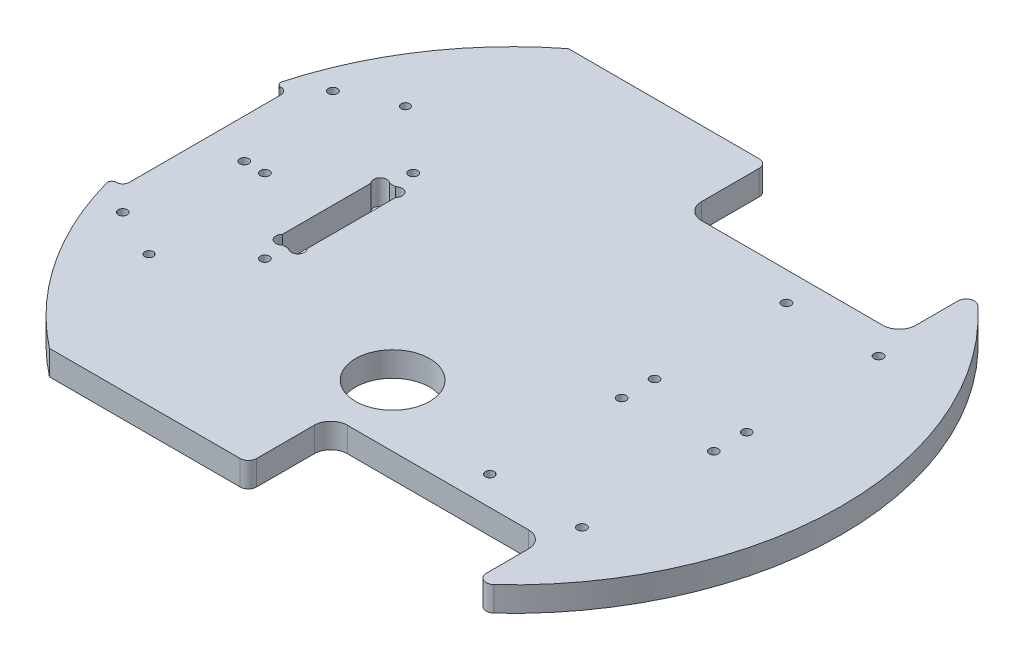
from build123d import *

# Parameters (mm, degrees)
ESQUISSE1_R      = 1.1
ESQUISSE1_R_2    = 1.05
ESQUISSE1_R_3    = 9
EXTRUSION1_DEPTH = 6


with BuildPart() as part:
    # Esquisse1 → Extrusion1 (new body)
    with BuildSketch(Plane(origin=(0, 0, 0), x_dir=(1, 0, 0), z_dir=(0, 1, 0))):
        with BuildLine():
            Line((-64.305172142, -63), (-18, -63))
            ThreePointArc((-18, -63), (-16.585786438, -62.414213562), (-16, -61))
            Line((-16, -61), (-16, -47))
            ThreePointArc((-16, -47), (-14.828427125, -44.171572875), (-12, -43))
            Line((-12, -43), (32, -43))
            ThreePointArc((32, -43), (34.828427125, -44.171572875), (36, -47))
            Line((36, -47), (36, -57.227615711))
            ThreePointArc((36, -57.227615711), (37.199359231, -59.060366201), (39.358974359, -58.694990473))
            ThreePointArc((39.358974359, -58.694990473), (65, 0), (39.358974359, 58.694990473))
            ThreePointArc((39.358974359, 58.694990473), (37.199359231, 59.060366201), (36, 57.227615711))
            Line((36, 57.227615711), (36, 47))
            ThreePointArc((36, 47), (34.828427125, 44.171572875), (32, 43))
            Line((32, 43), (-12, 43))
            ThreePointArc((-12, 43), (-14.828427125, 44.171572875), (-16, 47))
            Line((-16, 47), (-16, 61))
            ThreePointArc((-16, 61), (-16.585786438, 62.414213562), (-18, 63))
            Line((-18, 63), (-64.305172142, 63))
            ThreePointArc((-64.305172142, 63), (-81.568590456, 44.36916457), (-92.121752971, 21.265822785))
            ThreePointArc((-92.121752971, 21.265822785), (-91.953288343, 20.394121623), (-91.157731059, 20))
            Line((-91.157731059, 20), (-91.1, 20))
            ThreePointArc((-91.1, 20), (-89.96862915, 19.53137085), (-89.5, 18.4))
            Line((-89.5, 18.4), (-89.5, -18.4))
            ThreePointArc((-89.5, -18.4), (-89.96862915, -19.53137085), (-91.1, -20))
            Line((-91.1, -20), (-91.157731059, -20))
            ThreePointArc((-91.157731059, -20), (-91.953288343, -20.394121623), (-92.121752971, -21.265822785))
            ThreePointArc((-92.121752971, -21.265822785), (-81.568590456, -44.36916457), (-64.305172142, -63))
        make_face()
        with Locations(Location((15.6, -4, 0), (0, 0, 270))):
            Circle(ESQUISSE1_R, mode=Mode.SUBTRACT)
        with Locations(Location((37.959035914, -4, 0), (0, 0, 270))):
            Circle(ESQUISSE1_R, mode=Mode.SUBTRACT)
        with Locations(Location((37.959035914, -36, 0), (0, 0, 90))):
            Circle(ESQUISSE1_R, mode=Mode.SUBTRACT)
        with Locations(Location((15.6, -36, 0), (0, 0, 90))):
            Circle(ESQUISSE1_R, mode=Mode.SUBTRACT)
        with Locations(Location((37.959035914, 4, 0), (0, 0, 90))):
            Circle(ESQUISSE1_R, mode=Mode.SUBTRACT)
        with Locations(Location((37.959035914, 36, 0), (0, 0, 270))):
            Circle(ESQUISSE1_R, mode=Mode.SUBTRACT)
        with Locations(Location((15.6, 36, 0), (0, 0, 270))):
            Circle(ESQUISSE1_R, mode=Mode.SUBTRACT)
        with Locations(Location((15.6, 4, 0), (0, 0, 90))):
            Circle(ESQUISSE1_R, mode=Mode.SUBTRACT)
        with Locations(Location((-84, 25.5, 0), (0, 0, 270))):
            Circle(ESQUISSE1_R, mode=Mode.SUBTRACT)
        with Locations(Location((-84, -25.5, 0), (0, 0, 90))):
            Circle(ESQUISSE1_R, mode=Mode.SUBTRACT)
        with Locations(Location((-72, -31.1, 0), (0, 0, 90))):
            Circle(ESQUISSE1_R_2, mode=Mode.SUBTRACT)
        with Locations(Location((-72, 31.1, 0), (0, 0, 270))):
            Circle(ESQUISSE1_R_2, mode=Mode.SUBTRACT)
        with Locations(Location((-80, 0, 0), (0, 0, 270))):
            Circle(ESQUISSE1_R, mode=Mode.SUBTRACT)
        with Locations(Location((-57, 18, 0), (0, 0, 270))):
            Circle(ESQUISSE1_R, mode=Mode.SUBTRACT)
        with Locations(Location((-75, 0, 0), (0, 0, 270))):
            Circle(ESQUISSE1_R, mode=Mode.SUBTRACT)
        with Locations(Location((-57, -18, 0), (0, 0, 90))):
            Circle(ESQUISSE1_R, mode=Mode.SUBTRACT)
        with Locations(Location((-16, -28, 0), (0, 0, 270))):
            Circle(ESQUISSE1_R_3, mode=Mode.SUBTRACT)
        with BuildLine():
            Line((-54, 10.7372583), (-54, -10.7372583))
            ThreePointArc((-54, -10.7372583), (-54, -13), (-56.2627417, -13))
            Line((-56.2627417, -13), (-57.7372583, -13))
            ThreePointArc((-57.7372583, -13), (-60, -13), (-60, -10.7372583))
            Line((-60, -10.7372583), (-60, 10.7372583))
            ThreePointArc((-60, 10.7372583), (-60, 13), (-57.7372583, 13))
            Line((-57.7372583, 13), (-56.2627417, 13))
            ThreePointArc((-56.2627417, 13), (-54, 13), (-54, 10.7372583))
        make_face(mode=Mode.SUBTRACT)
    extrude(amount=EXTRUSION1_DEPTH)


solid = part.part
